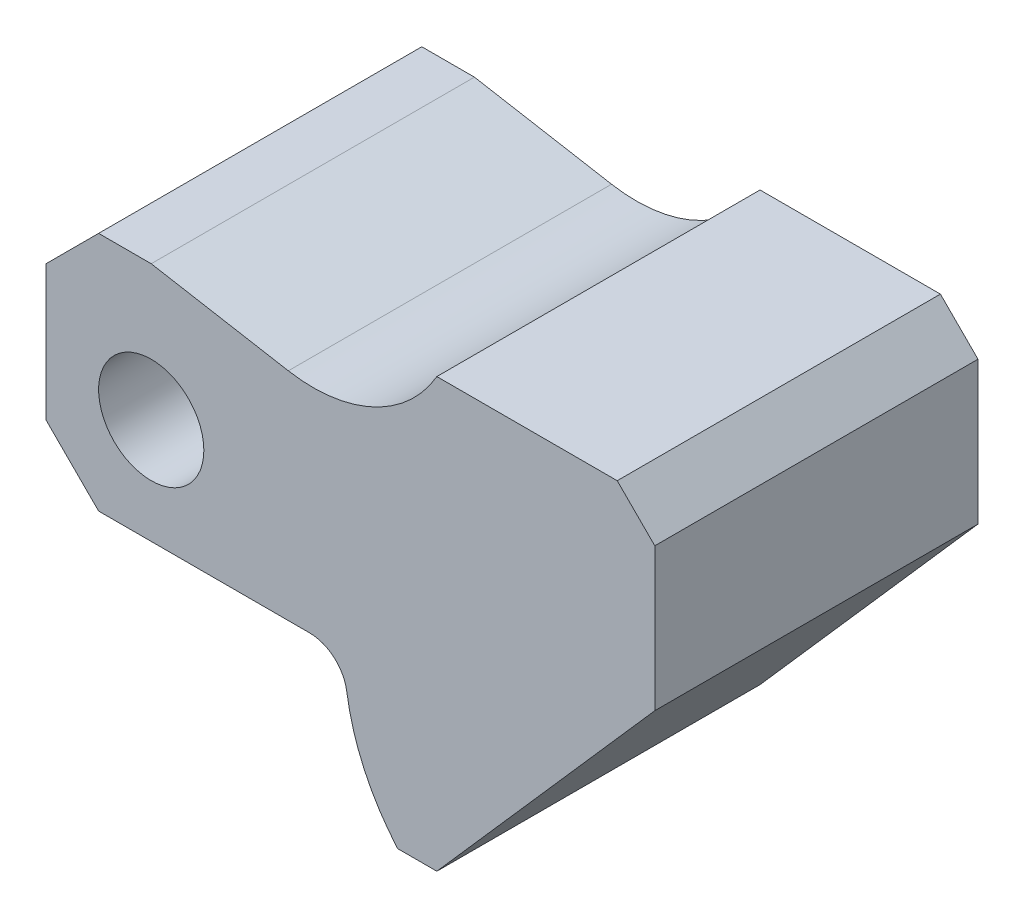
ISO-10303-21;
HEADER;
FILE_DESCRIPTION(('STEP AP214'),'2;1');
FILE_NAME('part.step','',(''),(''),'','','');
FILE_SCHEMA(('AUTOMOTIVE_DESIGN { 1 0 10303 214 1 1 1 1 }'));
ENDSEC;
DATA;
#1=APPLICATION_CONTEXT('core data for automotive mechanical design processes');
#2=APPLICATION_PROTOCOL_DEFINITION('international standard','automotive_design',2000,#1);
#3=PRODUCT_CONTEXT('',#1,'mechanical');
#4=PRODUCT('Part','Part','',(#3));
#5=PRODUCT_RELATED_PRODUCT_CATEGORY('part','',(#4));
#6=PRODUCT_DEFINITION_FORMATION('','',#4);
#7=PRODUCT_DEFINITION_CONTEXT('part definition',#1,'design');
#8=PRODUCT_DEFINITION('design','',#6,#7);
#9=PRODUCT_DEFINITION_SHAPE('','',#8);
#10=(LENGTH_UNIT() NAMED_UNIT(*) SI_UNIT(.MILLI.,.METRE.));
#11=(NAMED_UNIT(*) PLANE_ANGLE_UNIT() SI_UNIT($,.RADIAN.));
#12=(NAMED_UNIT(*) SI_UNIT($,.STERADIAN.) SOLID_ANGLE_UNIT());
#13=UNCERTAINTY_MEASURE_WITH_UNIT(LENGTH_MEASURE(1.E-05),#10,'distance_accuracy_value','');
#14=(GEOMETRIC_REPRESENTATION_CONTEXT(3) GLOBAL_UNCERTAINTY_ASSIGNED_CONTEXT((#13)) GLOBAL_UNIT_ASSIGNED_CONTEXT((#10,
#11,#12)) REPRESENTATION_CONTEXT('',''));
#15=CARTESIAN_POINT('',(0.,0.,0.));
#16=DIRECTION('',(0.,0.,1.));
#17=DIRECTION('',(1.,0.,0.));
#18=AXIS2_PLACEMENT_3D('',#15,#16,#17);
#19=CARTESIAN_POINT('',(21.5424003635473,33.4945992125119,43.));
#20=DIRECTION('',(0.,0.,-1.));
#21=DIRECTION('',(-1.,0.,0.));
#22=AXIS2_PLACEMENT_3D('',#19,#20,#21);
#23=PLANE('',#22);
#24=DIRECTION('',(0.707106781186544,-0.707106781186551,0.));
#25=VECTOR('',#24,1.);
#26=CARTESIAN_POINT('',(-7.00000000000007,-14.,43.));
#27=LINE('',#26,#25);
#28=CARTESIAN_POINT('',(-14.,-7.,43.));
#29=VERTEX_POINT('',#28);
#30=CARTESIAN_POINT('',(-7.00000000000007,-14.,43.));
#31=VERTEX_POINT('',#30);
#32=EDGE_CURVE('E195',#29,#31,#27,.T.);
#33=ORIENTED_EDGE('',*,*,#32,.T.);
#34=DIRECTION('',(1.,0.,0.));
#35=VECTOR('',#34,1.);
#36=CARTESIAN_POINT('',(21.0666262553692,-14.,43.));
#37=LINE('',#36,#35);
#38=CARTESIAN_POINT('',(21.0666262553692,-14.,43.));
#39=VERTEX_POINT('',#38);
#40=EDGE_CURVE('E113',#31,#39,#37,.T.);
#41=ORIENTED_EDGE('',*,*,#40,.T.);
#42=CARTESIAN_POINT('',(21.0666262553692,-19.,43.));
#43=DIRECTION('',(0.,0.,-1.));
#44=DIRECTION('',(1.,0.,0.));
#45=AXIS2_PLACEMENT_3D('',#42,#43,#44);
#46=CIRCLE('',#45,5.);
#47=CARTESIAN_POINT('',(26.0122649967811,-18.2647058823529,43.));
#48=VERTEX_POINT('',#47);
#49=EDGE_CURVE('E228',#39,#48,#46,.T.);
#50=ORIENTED_EDGE('',*,*,#49,.T.);
#51=CARTESIAN_POINT('',(54.6969696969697,-14.,43.));
#52=DIRECTION('',(0.,0.,1.));
#53=DIRECTION('',(-1.,0.,0.));
#54=AXIS2_PLACEMENT_3D('',#51,#52,#53);
#55=CIRCLE('',#54,29.);
#56=CARTESIAN_POINT('',(32.788067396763,-33.,43.));
#57=VERTEX_POINT('',#56);
#58=EDGE_CURVE('E247',#48,#57,#55,.T.);
#59=ORIENTED_EDGE('',*,*,#58,.T.);
#60=DIRECTION('',(1.,0.,0.));
#61=VECTOR('',#60,1.);
#62=CARTESIAN_POINT('',(38.,-33.,43.));
#63=LINE('',#62,#61);
#64=CARTESIAN_POINT('',(38.,-33.,43.));
#65=VERTEX_POINT('',#64);
#66=EDGE_CURVE('E244',#57,#65,#63,.T.);
#67=ORIENTED_EDGE('',*,*,#66,.T.);
#68=DIRECTION('',(0.660114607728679,0.751164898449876,0.));
#69=VECTOR('',#68,1.);
#70=CARTESIAN_POINT('',(67.,0.,43.));
#71=LINE('',#70,#69);
#72=CARTESIAN_POINT('',(67.,0.,43.));
#73=VERTEX_POINT('',#72);
#74=EDGE_CURVE('E246',#65,#73,#71,.T.);
#75=ORIENTED_EDGE('',*,*,#74,.T.);
#76=DIRECTION('',(0.,1.,0.));
#77=VECTOR('',#76,1.);
#78=CARTESIAN_POINT('',(67.,19.,43.));
#79=LINE('',#78,#77);
#80=CARTESIAN_POINT('',(67.,19.,43.));
#81=VERTEX_POINT('',#80);
#82=EDGE_CURVE('E249',#73,#81,#79,.T.);
#83=ORIENTED_EDGE('',*,*,#82,.T.);
#84=DIRECTION('',(-0.707106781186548,0.707106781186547,0.));
#85=VECTOR('',#84,1.);
#86=CARTESIAN_POINT('',(62.,24.,43.));
#87=LINE('',#86,#85);
#88=CARTESIAN_POINT('',(62.,24.,43.));
#89=VERTEX_POINT('',#88);
#90=EDGE_CURVE('E255',#81,#89,#87,.T.);
#91=ORIENTED_EDGE('',*,*,#90,.T.);
#92=DIRECTION('',(-1.,0.,0.));
#93=VECTOR('',#92,1.);
#94=CARTESIAN_POINT('',(38.,24.,43.));
#95=LINE('',#94,#93);
#96=CARTESIAN_POINT('',(38.,24.,43.));
#97=VERTEX_POINT('',#96);
#98=EDGE_CURVE('E257',#89,#97,#95,.T.);
#99=ORIENTED_EDGE('',*,*,#98,.T.);
#100=CARTESIAN_POINT('',(21.5424003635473,33.4945992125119,43.));
#101=DIRECTION('',(0.,0.,-1.));
#102=DIRECTION('',(-1.,0.,0.));
#103=AXIS2_PLACEMENT_3D('',#100,#101,#102);
#104=CIRCLE('',#103,19.);
#105=CARTESIAN_POINT('',(18.2430849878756,14.78325190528,43.));
#106=VERTEX_POINT('',#105);
#107=EDGE_CURVE('E259',#97,#106,#104,.T.);
#108=ORIENTED_EDGE('',*,*,#107,.T.);
#109=DIRECTION('',(-0.984807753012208,0.173648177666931,0.));
#110=VECTOR('',#109,1.);
#111=CARTESIAN_POINT('',(0.,18.,43.));
#112=LINE('',#111,#110);
#113=CARTESIAN_POINT('',(0.,18.,43.));
#114=VERTEX_POINT('',#113);
#115=EDGE_CURVE('E150',#106,#114,#112,.T.);
#116=ORIENTED_EDGE('',*,*,#115,.T.);
#117=DIRECTION('',(-1.,0.,0.));
#118=VECTOR('',#117,1.);
#119=CARTESIAN_POINT('',(-6.99999999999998,18.,43.));
#120=LINE('',#119,#118);
#121=CARTESIAN_POINT('',(-6.99999999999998,18.,43.));
#122=VERTEX_POINT('',#121);
#123=EDGE_CURVE('E144',#114,#122,#120,.T.);
#124=ORIENTED_EDGE('',*,*,#123,.T.);
#125=DIRECTION('',(-0.707106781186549,-0.707106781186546,0.));
#126=VECTOR('',#125,1.);
#127=CARTESIAN_POINT('',(-14.,11.,43.));
#128=LINE('',#127,#126);
#129=CARTESIAN_POINT('',(-14.,11.,43.));
#130=VERTEX_POINT('',#129);
#131=EDGE_CURVE('E148',#122,#130,#128,.T.);
#132=ORIENTED_EDGE('',*,*,#131,.T.);
#133=DIRECTION('',(0.,-1.,0.));
#134=VECTOR('',#133,1.);
#135=CARTESIAN_POINT('',(-14.,-7.,43.));
#136=LINE('',#135,#134);
#137=EDGE_CURVE('E52',#130,#29,#136,.T.);
#138=ORIENTED_EDGE('',*,*,#137,.T.);
#139=EDGE_LOOP('',(#33,#41,#50,#59,#67,#75,#83,#91,#99,#108,#116,#124,#132,#138));
#140=FACE_BOUND('',#139,.T.);
#141=CARTESIAN_POINT('',(0.,0.,43.));
#142=DIRECTION('',(0.,0.,1.));
#143=DIRECTION('',(1.,0.,0.));
#144=AXIS2_PLACEMENT_3D('',#141,#142,#143);
#145=CIRCLE('',#144,7.);
#146=CARTESIAN_POINT('',(7.,0.,43.));
#147=VERTEX_POINT('',#146);
#148=EDGE_CURVE('E172',#147,#147,#145,.T.);
#149=ORIENTED_EDGE('',*,*,#148,.F.);
#150=EDGE_LOOP('',(#149));
#151=FACE_BOUND('',#150,.T.);
#152=ADVANCED_FACE('F35',(#140,#151),#23,.F.);
#153=CARTESIAN_POINT('',(21.5424003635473,33.4945992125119,0.));
#154=DIRECTION('',(0.,0.,-1.));
#155=DIRECTION('',(-1.,0.,0.));
#156=AXIS2_PLACEMENT_3D('',#153,#154,#155);
#157=PLANE('',#156);
#158=DIRECTION('',(0.707106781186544,-0.707106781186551,0.));
#159=VECTOR('',#158,1.);
#160=CARTESIAN_POINT('',(-7.00000000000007,-14.,0.));
#161=LINE('',#160,#159);
#162=CARTESIAN_POINT('',(-14.,-7.,0.));
#163=VERTEX_POINT('',#162);
#164=CARTESIAN_POINT('',(-7.00000000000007,-14.,0.));
#165=VERTEX_POINT('',#164);
#166=EDGE_CURVE('E168',#163,#165,#161,.T.);
#167=ORIENTED_EDGE('',*,*,#166,.F.);
#168=DIRECTION('',(0.,-1.,0.));
#169=VECTOR('',#168,1.);
#170=CARTESIAN_POINT('',(-14.,-7.,0.));
#171=LINE('',#170,#169);
#172=CARTESIAN_POINT('',(-14.,11.,0.));
#173=VERTEX_POINT('',#172);
#174=EDGE_CURVE('E105',#173,#163,#171,.T.);
#175=ORIENTED_EDGE('',*,*,#174,.F.);
#176=DIRECTION('',(-0.707106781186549,-0.707106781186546,0.));
#177=VECTOR('',#176,1.);
#178=CARTESIAN_POINT('',(-14.,11.,0.));
#179=LINE('',#178,#177);
#180=CARTESIAN_POINT('',(-6.99999999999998,18.,0.));
#181=VERTEX_POINT('',#180);
#182=EDGE_CURVE('E99',#181,#173,#179,.T.);
#183=ORIENTED_EDGE('',*,*,#182,.F.);
#184=DIRECTION('',(-1.,0.,0.));
#185=VECTOR('',#184,1.);
#186=CARTESIAN_POINT('',(-6.99999999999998,18.,0.));
#187=LINE('',#186,#185);
#188=CARTESIAN_POINT('',(0.,18.,0.));
#189=VERTEX_POINT('',#188);
#190=EDGE_CURVE('E158',#189,#181,#187,.T.);
#191=ORIENTED_EDGE('',*,*,#190,.F.);
#192=DIRECTION('',(-0.984807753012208,0.173648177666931,0.));
#193=VECTOR('',#192,1.);
#194=CARTESIAN_POINT('',(0.,18.,0.));
#195=LINE('',#194,#193);
#196=CARTESIAN_POINT('',(18.2430849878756,14.78325190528,0.));
#197=VERTEX_POINT('',#196);
#198=EDGE_CURVE('E190',#197,#189,#195,.T.);
#199=ORIENTED_EDGE('',*,*,#198,.F.);
#200=CARTESIAN_POINT('',(21.5424003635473,33.4945992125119,0.));
#201=DIRECTION('',(0.,0.,-1.));
#202=DIRECTION('',(-1.,0.,0.));
#203=AXIS2_PLACEMENT_3D('',#200,#201,#202);
#204=CIRCLE('',#203,19.);
#205=CARTESIAN_POINT('',(38.,24.,0.));
#206=VERTEX_POINT('',#205);
#207=EDGE_CURVE('E188',#206,#197,#204,.T.);
#208=ORIENTED_EDGE('',*,*,#207,.F.);
#209=DIRECTION('',(-1.,0.,0.));
#210=VECTOR('',#209,1.);
#211=CARTESIAN_POINT('',(38.,24.,0.));
#212=LINE('',#211,#210);
#213=CARTESIAN_POINT('',(62.,24.,0.));
#214=VERTEX_POINT('',#213);
#215=EDGE_CURVE('E186',#214,#206,#212,.T.);
#216=ORIENTED_EDGE('',*,*,#215,.F.);
#217=DIRECTION('',(-0.707106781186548,0.707106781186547,0.));
#218=VECTOR('',#217,1.);
#219=CARTESIAN_POINT('',(62.,24.,0.));
#220=LINE('',#219,#218);
#221=CARTESIAN_POINT('',(67.,19.,0.));
#222=VERTEX_POINT('',#221);
#223=EDGE_CURVE('E184',#222,#214,#220,.T.);
#224=ORIENTED_EDGE('',*,*,#223,.F.);
#225=DIRECTION('',(0.,1.,0.));
#226=VECTOR('',#225,1.);
#227=CARTESIAN_POINT('',(67.,19.,0.));
#228=LINE('',#227,#226);
#229=CARTESIAN_POINT('',(67.,0.,0.));
#230=VERTEX_POINT('',#229);
#231=EDGE_CURVE('E182',#230,#222,#228,.T.);
#232=ORIENTED_EDGE('',*,*,#231,.F.);
#233=DIRECTION('',(0.660114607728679,0.751164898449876,0.));
#234=VECTOR('',#233,1.);
#235=CARTESIAN_POINT('',(67.,0.,0.));
#236=LINE('',#235,#234);
#237=CARTESIAN_POINT('',(38.,-33.,0.));
#238=VERTEX_POINT('',#237);
#239=EDGE_CURVE('E180',#238,#230,#236,.T.);
#240=ORIENTED_EDGE('',*,*,#239,.F.);
#241=DIRECTION('',(1.,0.,0.));
#242=VECTOR('',#241,1.);
#243=CARTESIAN_POINT('',(38.,-33.,0.));
#244=LINE('',#243,#242);
#245=CARTESIAN_POINT('',(32.788067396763,-33.,0.));
#246=VERTEX_POINT('',#245);
#247=EDGE_CURVE('E178',#246,#238,#244,.T.);
#248=ORIENTED_EDGE('',*,*,#247,.F.);
#249=CARTESIAN_POINT('',(54.6969696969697,-14.,0.));
#250=DIRECTION('',(0.,0.,1.));
#251=DIRECTION('',(-1.,0.,0.));
#252=AXIS2_PLACEMENT_3D('',#249,#250,#251);
#253=CIRCLE('',#252,29.);
#254=CARTESIAN_POINT('',(26.0122649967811,-18.2647058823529,0.));
#255=VERTEX_POINT('',#254);
#256=EDGE_CURVE('E176',#255,#246,#253,.T.);
#257=ORIENTED_EDGE('',*,*,#256,.F.);
#258=CARTESIAN_POINT('',(21.0666262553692,-19.,0.));
#259=DIRECTION('',(0.,0.,-1.));
#260=DIRECTION('',(1.,0.,0.));
#261=AXIS2_PLACEMENT_3D('',#258,#259,#260);
#262=CIRCLE('',#261,5.);
#263=CARTESIAN_POINT('',(21.0666262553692,-14.,0.));
#264=VERTEX_POINT('',#263);
#265=EDGE_CURVE('E174',#264,#255,#262,.T.);
#266=ORIENTED_EDGE('',*,*,#265,.F.);
#267=DIRECTION('',(1.,0.,0.));
#268=VECTOR('',#267,1.);
#269=CARTESIAN_POINT('',(21.0666262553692,-14.,0.));
#270=LINE('',#269,#268);
#271=EDGE_CURVE('E171',#165,#264,#270,.T.);
#272=ORIENTED_EDGE('',*,*,#271,.F.);
#273=EDGE_LOOP('',(#167,#175,#183,#191,#199,#208,#216,#224,#232,#240,#248,#257,#266,#272));
#274=FACE_BOUND('',#273,.T.);
#275=CARTESIAN_POINT('',(0.,0.,0.));
#276=DIRECTION('',(0.,0.,1.));
#277=DIRECTION('',(1.,0.,0.));
#278=AXIS2_PLACEMENT_3D('',#275,#276,#277);
#279=CIRCLE('',#278,7.);
#280=CARTESIAN_POINT('',(7.,0.,0.));
#281=VERTEX_POINT('',#280);
#282=EDGE_CURVE('E432',#281,#281,#279,.T.);
#283=ORIENTED_EDGE('',*,*,#282,.T.);
#284=EDGE_LOOP('',(#283));
#285=FACE_BOUND('',#284,.T.);
#286=ADVANCED_FACE('F232',(#274,#285),#157,.T.);
#287=CARTESIAN_POINT('',(-7.00000000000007,-14.,43.));
#288=DIRECTION('',(0.707106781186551,0.707106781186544,0.));
#289=DIRECTION('',(-0.707106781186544,0.707106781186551,0.));
#290=AXIS2_PLACEMENT_3D('',#287,#288,#289);
#291=PLANE('',#290);
#292=ORIENTED_EDGE('',*,*,#166,.T.);
#293=DIRECTION('',(0.,0.,-1.));
#294=VECTOR('',#293,1.);
#295=CARTESIAN_POINT('',(-7.00000000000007,-14.,43.));
#296=LINE('',#295,#294);
#297=EDGE_CURVE('E11',#31,#165,#296,.T.);
#298=ORIENTED_EDGE('',*,*,#297,.F.);
#299=ORIENTED_EDGE('',*,*,#32,.F.);
#300=DIRECTION('',(0.,0.,-1.));
#301=VECTOR('',#300,1.);
#302=CARTESIAN_POINT('',(-14.,-7.,43.));
#303=LINE('',#302,#301);
#304=EDGE_CURVE('E164',#29,#163,#303,.T.);
#305=ORIENTED_EDGE('',*,*,#304,.T.);
#306=EDGE_LOOP('',(#292,#298,#299,#305));
#307=FACE_BOUND('',#306,.T.);
#308=ADVANCED_FACE('F37',(#307),#291,.F.);
#309=CARTESIAN_POINT('',(21.0666262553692,-14.,43.));
#310=DIRECTION('',(0.,1.,0.));
#311=DIRECTION('',(-1.,0.,0.));
#312=AXIS2_PLACEMENT_3D('',#309,#310,#311);
#313=PLANE('',#312);
#314=ORIENTED_EDGE('',*,*,#271,.T.);
#315=DIRECTION('',(0.,0.,-1.));
#316=VECTOR('',#315,1.);
#317=CARTESIAN_POINT('',(21.0666262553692,-14.,43.));
#318=LINE('',#317,#316);
#319=EDGE_CURVE('E44',#39,#264,#318,.T.);
#320=ORIENTED_EDGE('',*,*,#319,.F.);
#321=ORIENTED_EDGE('',*,*,#40,.F.);
#322=ORIENTED_EDGE('',*,*,#297,.T.);
#323=EDGE_LOOP('',(#314,#320,#321,#322));
#324=FACE_BOUND('',#323,.T.);
#325=ADVANCED_FACE('F293',(#324),#313,.F.);
#326=CARTESIAN_POINT('',(21.0666262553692,-19.,43.));
#327=DIRECTION('',(0.,0.,-1.));
#328=DIRECTION('',(-1.,0.,0.));
#329=AXIS2_PLACEMENT_3D('',#326,#327,#328);
#330=CYLINDRICAL_SURFACE('',#329,5.);
#331=ORIENTED_EDGE('',*,*,#265,.T.);
#332=DIRECTION('',(0.,0.,-1.));
#333=VECTOR('',#332,1.);
#334=CARTESIAN_POINT('',(26.0122649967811,-18.2647058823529,43.));
#335=LINE('',#334,#333);
#336=EDGE_CURVE('E220',#48,#255,#335,.T.);
#337=ORIENTED_EDGE('',*,*,#336,.F.);
#338=ORIENTED_EDGE('',*,*,#49,.F.);
#339=ORIENTED_EDGE('',*,*,#319,.T.);
#340=EDGE_LOOP('',(#331,#337,#338,#339));
#341=FACE_BOUND('',#340,.T.);
#342=ADVANCED_FACE('F226',(#341),#330,.F.);
#343=CARTESIAN_POINT('',(54.6969696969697,-14.,43.));
#344=DIRECTION('',(0.,0.,-1.));
#345=DIRECTION('',(-1.,0.,0.));
#346=AXIS2_PLACEMENT_3D('',#343,#344,#345);
#347=CYLINDRICAL_SURFACE('',#346,29.);
#348=ORIENTED_EDGE('',*,*,#256,.T.);
#349=DIRECTION('',(0.,0.,-1.));
#350=VECTOR('',#349,1.);
#351=CARTESIAN_POINT('',(32.788067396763,-33.,43.));
#352=LINE('',#351,#350);
#353=EDGE_CURVE('E217',#57,#246,#352,.T.);
#354=ORIENTED_EDGE('',*,*,#353,.F.);
#355=ORIENTED_EDGE('',*,*,#58,.F.);
#356=ORIENTED_EDGE('',*,*,#336,.T.);
#357=EDGE_LOOP('',(#348,#354,#355,#356));
#358=FACE_BOUND('',#357,.T.);
#359=ADVANCED_FACE('F238',(#358),#347,.T.);
#360=CARTESIAN_POINT('',(38.,-33.,43.));
#361=DIRECTION('',(0.,1.,0.));
#362=DIRECTION('',(-1.,0.,0.));
#363=AXIS2_PLACEMENT_3D('',#360,#361,#362);
#364=PLANE('',#363);
#365=ORIENTED_EDGE('',*,*,#247,.T.);
#366=DIRECTION('',(0.,0.,-1.));
#367=VECTOR('',#366,1.);
#368=CARTESIAN_POINT('',(38.,-33.,43.));
#369=LINE('',#368,#367);
#370=EDGE_CURVE('E214',#65,#238,#369,.T.);
#371=ORIENTED_EDGE('',*,*,#370,.F.);
#372=ORIENTED_EDGE('',*,*,#66,.F.);
#373=ORIENTED_EDGE('',*,*,#353,.T.);
#374=EDGE_LOOP('',(#365,#371,#372,#373));
#375=FACE_BOUND('',#374,.T.);
#376=ADVANCED_FACE('F242',(#375),#364,.F.);
#377=CARTESIAN_POINT('',(67.,0.,43.));
#378=DIRECTION('',(-0.751164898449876,0.660114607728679,0.));
#379=DIRECTION('',(-0.660114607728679,-0.751164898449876,0.));
#380=AXIS2_PLACEMENT_3D('',#377,#378,#379);
#381=PLANE('',#380);
#382=ORIENTED_EDGE('',*,*,#239,.T.);
#383=DIRECTION('',(0.,0.,-1.));
#384=VECTOR('',#383,1.);
#385=CARTESIAN_POINT('',(67.,0.,43.));
#386=LINE('',#385,#384);
#387=EDGE_CURVE('E211',#73,#230,#386,.T.);
#388=ORIENTED_EDGE('',*,*,#387,.F.);
#389=ORIENTED_EDGE('',*,*,#74,.F.);
#390=ORIENTED_EDGE('',*,*,#370,.T.);
#391=EDGE_LOOP('',(#382,#388,#389,#390));
#392=FACE_BOUND('',#391,.T.);
#393=ADVANCED_FACE('F306',(#392),#381,.F.);
#394=CARTESIAN_POINT('',(67.,19.,43.));
#395=DIRECTION('',(-1.,0.,0.));
#396=DIRECTION('',(0.,0.,1.));
#397=AXIS2_PLACEMENT_3D('',#394,#395,#396);
#398=PLANE('',#397);
#399=ORIENTED_EDGE('',*,*,#231,.T.);
#400=DIRECTION('',(0.,0.,-1.));
#401=VECTOR('',#400,1.);
#402=CARTESIAN_POINT('',(67.,19.,43.));
#403=LINE('',#402,#401);
#404=EDGE_CURVE('E208',#81,#222,#403,.T.);
#405=ORIENTED_EDGE('',*,*,#404,.F.);
#406=ORIENTED_EDGE('',*,*,#82,.F.);
#407=ORIENTED_EDGE('',*,*,#387,.T.);
#408=EDGE_LOOP('',(#399,#405,#406,#407));
#409=FACE_BOUND('',#408,.T.);
#410=ADVANCED_FACE('F309',(#409),#398,.F.);
#411=CARTESIAN_POINT('',(62.,24.,43.));
#412=DIRECTION('',(-0.707106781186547,-0.707106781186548,0.));
#413=DIRECTION('',(0.707106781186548,-0.707106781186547,0.));
#414=AXIS2_PLACEMENT_3D('',#411,#412,#413);
#415=PLANE('',#414);
#416=ORIENTED_EDGE('',*,*,#223,.T.);
#417=DIRECTION('',(0.,0.,-1.));
#418=VECTOR('',#417,1.);
#419=CARTESIAN_POINT('',(62.,24.,43.));
#420=LINE('',#419,#418);
#421=EDGE_CURVE('E205',#89,#214,#420,.T.);
#422=ORIENTED_EDGE('',*,*,#421,.F.);
#423=ORIENTED_EDGE('',*,*,#90,.F.);
#424=ORIENTED_EDGE('',*,*,#404,.T.);
#425=EDGE_LOOP('',(#416,#422,#423,#424));
#426=FACE_BOUND('',#425,.T.);
#427=ADVANCED_FACE('F313',(#426),#415,.F.);
#428=CARTESIAN_POINT('',(38.,24.,43.));
#429=DIRECTION('',(0.,-1.,0.));
#430=DIRECTION('',(0.,0.,-1.));
#431=AXIS2_PLACEMENT_3D('',#428,#429,#430);
#432=PLANE('',#431);
#433=ORIENTED_EDGE('',*,*,#215,.T.);
#434=DIRECTION('',(0.,0.,-1.));
#435=VECTOR('',#434,1.);
#436=CARTESIAN_POINT('',(38.,24.,43.));
#437=LINE('',#436,#435);
#438=EDGE_CURVE('E202',#97,#206,#437,.T.);
#439=ORIENTED_EDGE('',*,*,#438,.F.);
#440=ORIENTED_EDGE('',*,*,#98,.F.);
#441=ORIENTED_EDGE('',*,*,#421,.T.);
#442=EDGE_LOOP('',(#433,#439,#440,#441));
#443=FACE_BOUND('',#442,.T.);
#444=ADVANCED_FACE('F317',(#443),#432,.F.);
#445=CARTESIAN_POINT('',(21.5424003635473,33.4945992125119,43.));
#446=DIRECTION('',(0.,0.,-1.));
#447=DIRECTION('',(-1.,0.,0.));
#448=AXIS2_PLACEMENT_3D('',#445,#446,#447);
#449=CYLINDRICAL_SURFACE('',#448,19.);
#450=ORIENTED_EDGE('',*,*,#207,.T.);
#451=DIRECTION('',(0.,0.,-1.));
#452=VECTOR('',#451,1.);
#453=CARTESIAN_POINT('',(18.2430849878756,14.78325190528,43.));
#454=LINE('',#453,#452);
#455=EDGE_CURVE('E199',#106,#197,#454,.T.);
#456=ORIENTED_EDGE('',*,*,#455,.F.);
#457=ORIENTED_EDGE('',*,*,#107,.F.);
#458=ORIENTED_EDGE('',*,*,#438,.T.);
#459=EDGE_LOOP('',(#450,#456,#457,#458));
#460=FACE_BOUND('',#459,.T.);
#461=ADVANCED_FACE('F265',(#460),#449,.F.);
#462=CARTESIAN_POINT('',(0.,18.,43.));
#463=DIRECTION('',(-0.173648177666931,-0.984807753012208,0.));
#464=DIRECTION('',(0.984807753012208,-0.173648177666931,0.));
#465=AXIS2_PLACEMENT_3D('',#462,#463,#464);
#466=PLANE('',#465);
#467=ORIENTED_EDGE('',*,*,#198,.T.);
#468=DIRECTION('',(0.,0.,-1.));
#469=VECTOR('',#468,1.);
#470=CARTESIAN_POINT('',(0.,18.,43.));
#471=LINE('',#470,#469);
#472=EDGE_CURVE('E159',#114,#189,#471,.T.);
#473=ORIENTED_EDGE('',*,*,#472,.F.);
#474=ORIENTED_EDGE('',*,*,#115,.F.);
#475=ORIENTED_EDGE('',*,*,#455,.T.);
#476=EDGE_LOOP('',(#467,#473,#474,#475));
#477=FACE_BOUND('',#476,.T.);
#478=ADVANCED_FACE('F269',(#477),#466,.F.);
#479=CARTESIAN_POINT('',(-6.99999999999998,18.,43.));
#480=DIRECTION('',(0.,-1.,0.));
#481=DIRECTION('',(0.,0.,-1.));
#482=AXIS2_PLACEMENT_3D('',#479,#480,#481);
#483=PLANE('',#482);
#484=ORIENTED_EDGE('',*,*,#190,.T.);
#485=DIRECTION('',(0.,0.,-1.));
#486=VECTOR('',#485,1.);
#487=CARTESIAN_POINT('',(-6.99999999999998,18.,43.));
#488=LINE('',#487,#486);
#489=EDGE_CURVE('E155',#122,#181,#488,.T.);
#490=ORIENTED_EDGE('',*,*,#489,.F.);
#491=ORIENTED_EDGE('',*,*,#123,.F.);
#492=ORIENTED_EDGE('',*,*,#472,.T.);
#493=EDGE_LOOP('',(#484,#490,#491,#492));
#494=FACE_BOUND('',#493,.T.);
#495=ADVANCED_FACE('F156',(#494),#483,.F.);
#496=CARTESIAN_POINT('',(-14.,11.,43.));
#497=DIRECTION('',(0.707106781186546,-0.707106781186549,0.));
#498=DIRECTION('',(0.707106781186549,0.707106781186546,0.));
#499=AXIS2_PLACEMENT_3D('',#496,#497,#498);
#500=PLANE('',#499);
#501=ORIENTED_EDGE('',*,*,#182,.T.);
#502=DIRECTION('',(0.,0.,-1.));
#503=VECTOR('',#502,1.);
#504=CARTESIAN_POINT('',(-14.,11.,43.));
#505=LINE('',#504,#503);
#506=EDGE_CURVE('E160',#130,#173,#505,.T.);
#507=ORIENTED_EDGE('',*,*,#506,.F.);
#508=ORIENTED_EDGE('',*,*,#131,.F.);
#509=ORIENTED_EDGE('',*,*,#489,.T.);
#510=EDGE_LOOP('',(#501,#507,#508,#509));
#511=FACE_BOUND('',#510,.T.);
#512=ADVANCED_FACE('F162',(#511),#500,.F.);
#513=CARTESIAN_POINT('',(-14.,-7.,43.));
#514=DIRECTION('',(1.,0.,0.));
#515=DIRECTION('',(0.,0.,-1.));
#516=AXIS2_PLACEMENT_3D('',#513,#514,#515);
#517=PLANE('',#516);
#518=ORIENTED_EDGE('',*,*,#174,.T.);
#519=ORIENTED_EDGE('',*,*,#304,.F.);
#520=ORIENTED_EDGE('',*,*,#137,.F.);
#521=ORIENTED_EDGE('',*,*,#506,.T.);
#522=EDGE_LOOP('',(#518,#519,#520,#521));
#523=FACE_BOUND('',#522,.T.);
#524=ADVANCED_FACE('F273',(#523),#517,.F.);
#525=CARTESIAN_POINT('',(0.,0.,43.));
#526=DIRECTION('',(0.,0.,-1.));
#527=DIRECTION('',(-1.,0.,0.));
#528=AXIS2_PLACEMENT_3D('',#525,#526,#527);
#529=CYLINDRICAL_SURFACE('',#528,7.);
#530=ORIENTED_EDGE('',*,*,#148,.T.);
#531=EDGE_LOOP('',(#530));
#532=FACE_BOUND('',#531,.T.);
#533=ORIENTED_EDGE('',*,*,#282,.F.);
#534=EDGE_LOOP('',(#533));
#535=FACE_BOUND('',#534,.T.);
#536=ADVANCED_FACE('F275',(#532,#535),#529,.F.);
#537=CLOSED_SHELL('',(#152,#286,#308,#325,#342,#359,#376,#393,#410,#427,#444,#461,#478,#495,
#512,#524,#536));
#538=MANIFOLD_SOLID_BREP('B2',#537);
#539=ADVANCED_BREP_SHAPE_REPRESENTATION('',(#18,#538),#14);
#540=SHAPE_DEFINITION_REPRESENTATION(#9,#539);
ENDSEC;
END-ISO-10303-21;
